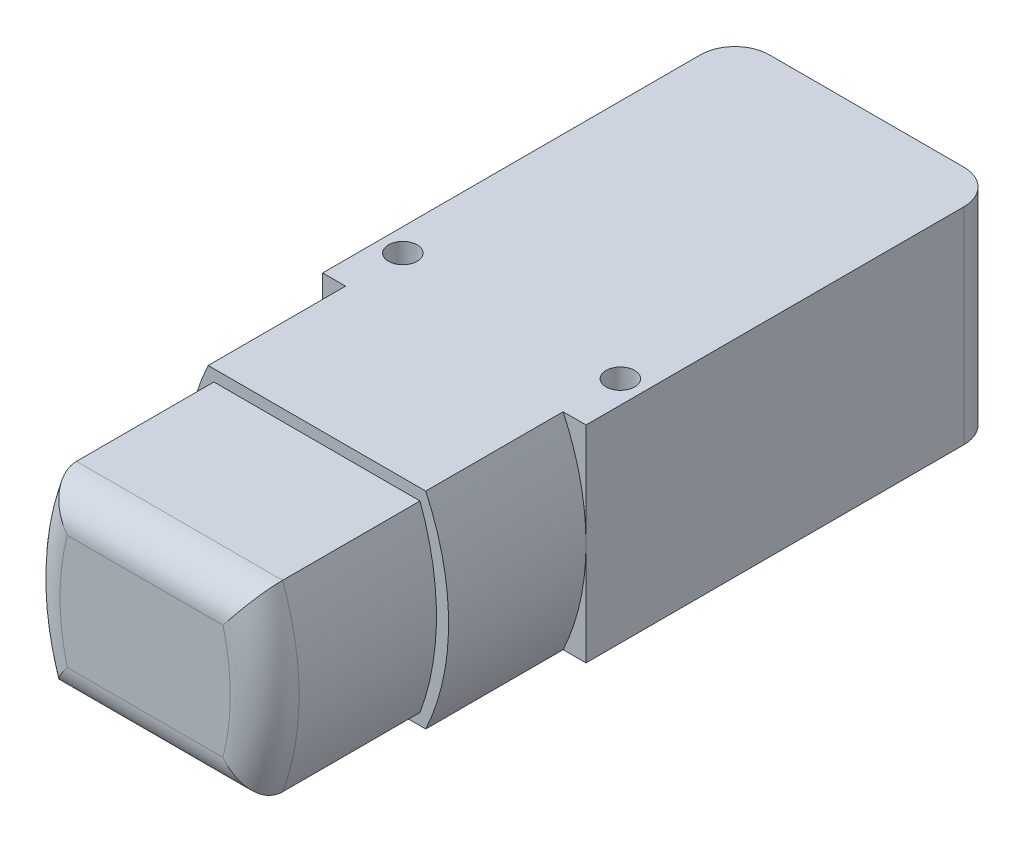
from build123d import *

# Parameters (mm, degrees)
CROQUIS1_W              = 23
CROQUIS1_H              = 18
SALIENTE_EXTRUIR1_DEPTH = 36
REDONDEO1_R             = 3
SALIENTE_EXTRUIR2_DEPTH = 12
SALIENTE_EXTRUIR3_DEPTH = 15
REDONDEO2_R             = 3
CROQUIS8_R              = 1.25
CORTAR_EXTRUIR3_DEPTH   = 67.522552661


with BuildPart() as part:
    # Croquis1 → Saliente-Extruir1 (new body)
    with BuildSketch(Plane.XY):
        Rectangle(CROQUIS1_W, CROQUIS1_H)
    extrude(amount=SALIENTE_EXTRUIR1_DEPTH)

    # Redondeo1
    redondeo1_edges = [part.edges().sort_by_distance(p)[0] for p in [
        (-11.5, 0, 0),
        (11.5, 0, 0),
    ]]
    fillet(redondeo1_edges, radius=REDONDEO1_R)

    # Croquis2 → Saliente-Extruir2 (add)
    with BuildSketch(Plane.XY.offset(36)):
        with BuildLine():
            Line((-9.5, 9), (9.5, 9))
            ThreePointArc((9.5, 9), (11.5, 0), (9.5, -9))
            Line((9.5, -9), (-9.5, -9))
            ThreePointArc((-9.5, -9), (-11.5, 0), (-9.5, 9))
        make_face()
    extrude(amount=SALIENTE_EXTRUIR2_DEPTH)

    # Croquis3 → Saliente-Extruir3 (add)
    with BuildSketch(Plane.XY.offset(48)):
        with BuildLine():
            Line((-9, 8), (9, 8))
            ThreePointArc((9, 8), (10.436141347, 0), (9, -8))
            Line((9, -8), (-9, -8))
            ThreePointArc((-9, -8), (-10.436141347, 0), (-9, 8))
        make_face()
    extrude(amount=SALIENTE_EXTRUIR3_DEPTH)

    # Redondeo2
    redondeo2_edges = [part.edges().sort_by_distance(p)[0] for p in [
        (-10.436141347, 0, 63),
        (0, -8, 63),
        (10.436141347, 0, 63),
        (0, 8, 63),
    ]]
    fillet(redondeo2_edges, radius=REDONDEO2_R)

    # Croquis8 → Cortar-Extruir3 (cut, through all)
    with BuildSketch(Plane.XZ.offset(9)):
        with Locations(Location((-9.5, 31, 0), (0, 0, 270))):
            Circle(CROQUIS8_R)
        with Locations(Location((9.5, 31, 0), (0, 0, 270))):
            Circle(CROQUIS8_R)
    extrude(amount=-CORTAR_EXTRUIR3_DEPTH, mode=Mode.SUBTRACT)


solid = part.part
